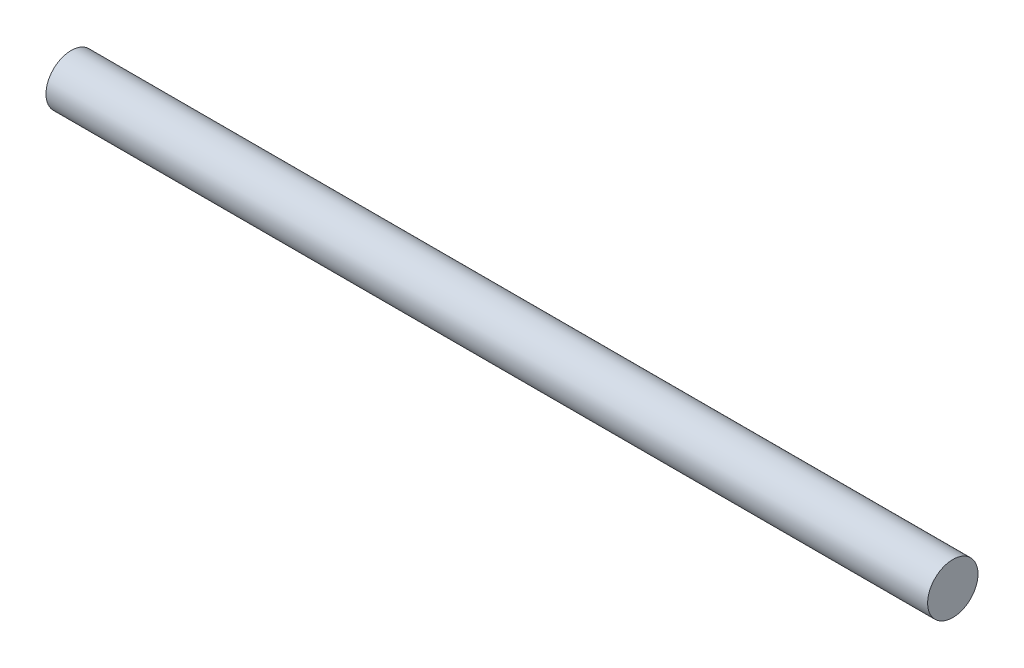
ISO-10303-21;
HEADER;
FILE_DESCRIPTION(('STEP AP214'),'2;1');
FILE_NAME('part.step','',(''),(''),'','','');
FILE_SCHEMA(('AUTOMOTIVE_DESIGN { 1 0 10303 214 1 1 1 1 }'));
ENDSEC;
DATA;
#1=APPLICATION_CONTEXT('core data for automotive mechanical design processes');
#2=APPLICATION_PROTOCOL_DEFINITION('international standard','automotive_design',2000,#1);
#3=PRODUCT_CONTEXT('',#1,'mechanical');
#4=PRODUCT('Part','Part','',(#3));
#5=PRODUCT_RELATED_PRODUCT_CATEGORY('part','',(#4));
#6=PRODUCT_DEFINITION_FORMATION('','',#4);
#7=PRODUCT_DEFINITION_CONTEXT('part definition',#1,'design');
#8=PRODUCT_DEFINITION('design','',#6,#7);
#9=PRODUCT_DEFINITION_SHAPE('','',#8);
#10=(LENGTH_UNIT() NAMED_UNIT(*) SI_UNIT(.MILLI.,.METRE.));
#11=(NAMED_UNIT(*) PLANE_ANGLE_UNIT() SI_UNIT($,.RADIAN.));
#12=(NAMED_UNIT(*) SI_UNIT($,.STERADIAN.) SOLID_ANGLE_UNIT());
#13=UNCERTAINTY_MEASURE_WITH_UNIT(LENGTH_MEASURE(1.E-05),#10,'distance_accuracy_value','');
#14=(GEOMETRIC_REPRESENTATION_CONTEXT(3) GLOBAL_UNCERTAINTY_ASSIGNED_CONTEXT((#13)) GLOBAL_UNIT_ASSIGNED_CONTEXT((#10,
#11,#12)) REPRESENTATION_CONTEXT('',''));
#15=CARTESIAN_POINT('',(0.,0.,0.));
#16=DIRECTION('',(0.,0.,1.));
#17=DIRECTION('',(1.,0.,0.));
#18=AXIS2_PLACEMENT_3D('',#15,#16,#17);
#19=CARTESIAN_POINT('',(70.,0.,0.));
#20=DIRECTION('',(-1.,0.,0.));
#21=DIRECTION('',(0.,0.,1.));
#22=AXIS2_PLACEMENT_3D('',#19,#20,#21);
#23=CYLINDRICAL_SURFACE('',#22,4.);
#24=CARTESIAN_POINT('',(70.,0.,0.));
#25=DIRECTION('',(1.,0.,0.));
#26=DIRECTION('',(0.,0.,-1.));
#27=AXIS2_PLACEMENT_3D('',#24,#25,#26);
#28=CIRCLE('',#27,4.);
#29=CARTESIAN_POINT('',(70.,0.,-4.));
#30=VERTEX_POINT('',#29);
#31=EDGE_CURVE('E10',#30,#30,#28,.T.);
#32=ORIENTED_EDGE('',*,*,#31,.F.);
#33=EDGE_LOOP('',(#32));
#34=FACE_BOUND('',#33,.T.);
#35=CARTESIAN_POINT('',(-70.,0.,0.));
#36=DIRECTION('',(1.,0.,0.));
#37=DIRECTION('',(0.,0.,-1.));
#38=AXIS2_PLACEMENT_3D('',#35,#36,#37);
#39=CIRCLE('',#38,4.);
#40=CARTESIAN_POINT('',(-70.,0.,-4.));
#41=VERTEX_POINT('',#40);
#42=EDGE_CURVE('E35',#41,#41,#39,.T.);
#43=ORIENTED_EDGE('',*,*,#42,.T.);
#44=EDGE_LOOP('',(#43));
#45=FACE_BOUND('',#44,.T.);
#46=ADVANCED_FACE('F32',(#34,#45),#23,.T.);
#47=CARTESIAN_POINT('',(70.,0.,0.));
#48=DIRECTION('',(1.,0.,0.));
#49=DIRECTION('',(0.,0.,-1.));
#50=AXIS2_PLACEMENT_3D('',#47,#48,#49);
#51=PLANE('',#50);
#52=ORIENTED_EDGE('',*,*,#31,.T.);
#53=EDGE_LOOP('',(#52));
#54=FACE_BOUND('',#53,.T.);
#55=ADVANCED_FACE('F47',(#54),#51,.T.);
#56=CARTESIAN_POINT('',(-70.,0.,0.));
#57=DIRECTION('',(1.,0.,0.));
#58=DIRECTION('',(0.,0.,-1.));
#59=AXIS2_PLACEMENT_3D('',#56,#57,#58);
#60=PLANE('',#59);
#61=ORIENTED_EDGE('',*,*,#42,.F.);
#62=EDGE_LOOP('',(#61));
#63=FACE_BOUND('',#62,.T.);
#64=ADVANCED_FACE('F45',(#63),#60,.F.);
#65=CLOSED_SHELL('',(#46,#55,#64));
#66=MANIFOLD_SOLID_BREP('B2',#65);
#67=ADVANCED_BREP_SHAPE_REPRESENTATION('',(#18,#66),#14);
#68=SHAPE_DEFINITION_REPRESENTATION(#9,#67);
ENDSEC;
END-ISO-10303-21;
